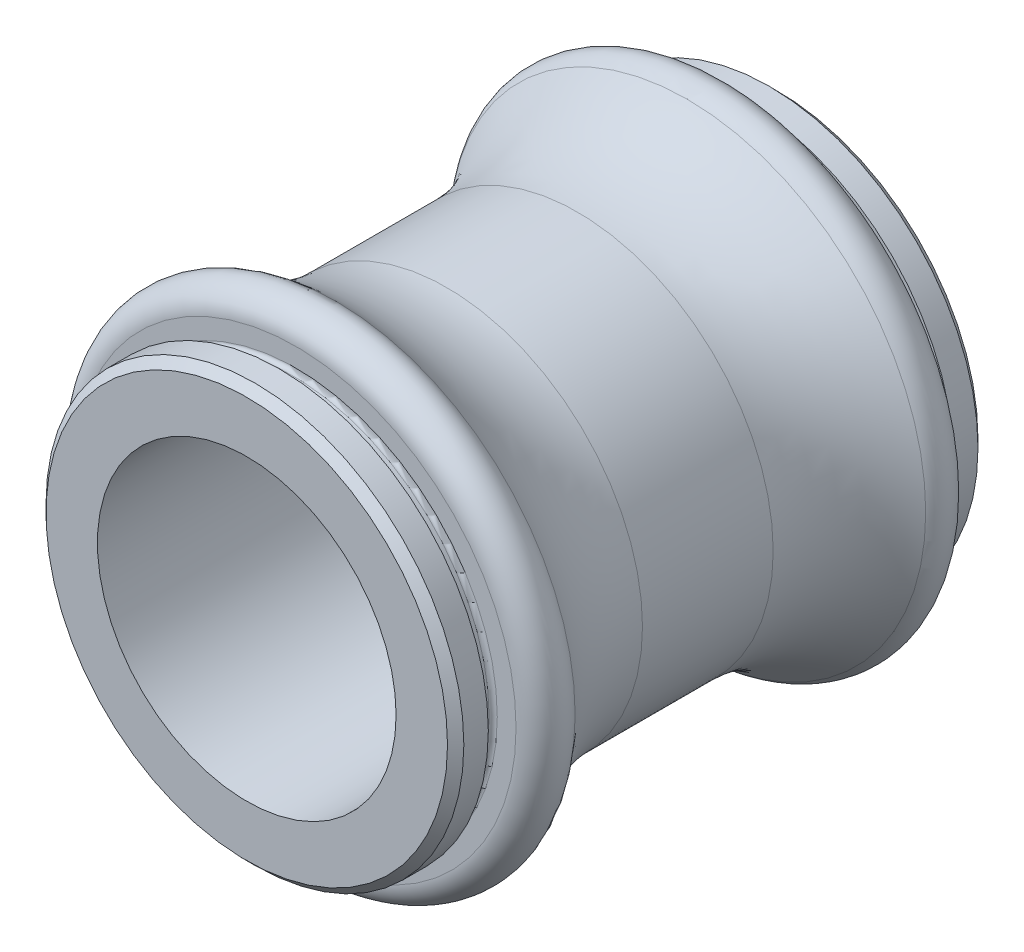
from build123d import *


with BuildPart() as part:
    # Sketch 1 → Revolve 1 (revolve)
    with BuildSketch(Plane(origin=(0, 0, 0), x_dir=(0, 0, -1), z_dir=(1, 0, 0)), mode=Mode.PRIVATE) as revolve_1_sk:
        with BuildLine():
            Line((-32.5, 9.15), (0, 9.15))
            Line((0, 9.15), (0, 12.3))
            Line((0, 12.3), (-0.5, 12.8))
            Line((-0.5, 12.8), (-2, 12.8))
            Line((-2, 12.8), (-2, 12.35))
            ThreePointArc((-2, 12.35), (-2.073223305, 12.173223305), (-2.25, 12.1))
            Line((-2.25, 12.1), (-2.75, 12.1))
            ThreePointArc((-2.75, 12.1), (-2.926776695, 12.173223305), (-3, 12.35))
            Line((-3, 12.35), (-3, 13.5))
            ThreePointArc((-3, 13.5), (-3.893994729, 14.872136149), (-5.510343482, 14.608695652))
            ThreePointArc((-5.510343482, 14.608695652), (-8.6343911, 12.674951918), (-12.245966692, 12))
            Line((-12.245966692, 12), (-20.254033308, 12))
            ThreePointArc((-20.254033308, 12), (-23.8656089, 12.674951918), (-26.989656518, 14.608695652))
            ThreePointArc((-26.989656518, 14.608695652), (-28.606005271, 14.872136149), (-29.5, 13.5))
            Line((-29.5, 13.5), (-29.5, 12.35))
            ThreePointArc((-29.5, 12.35), (-29.573223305, 12.173223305), (-29.75, 12.1))
            Line((-29.75, 12.1), (-30.25, 12.1))
            ThreePointArc((-30.25, 12.1), (-30.426776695, 12.173223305), (-30.5, 12.35))
            Line((-30.5, 12.35), (-30.5, 12.8))
            Line((-30.5, 12.8), (-32, 12.8))
            Line((-32, 12.8), (-32.5, 12.3))
            Line((-32.5, 12.3), (-32.5, 9.15))
        make_face()
    revolve(revolve_1_sk.sketch.rotate(Axis((0, 0, 0), (0, 0, 1)), 270), axis=Axis((0, 0, 0), (0, 0, 1)))


solid = part.part
